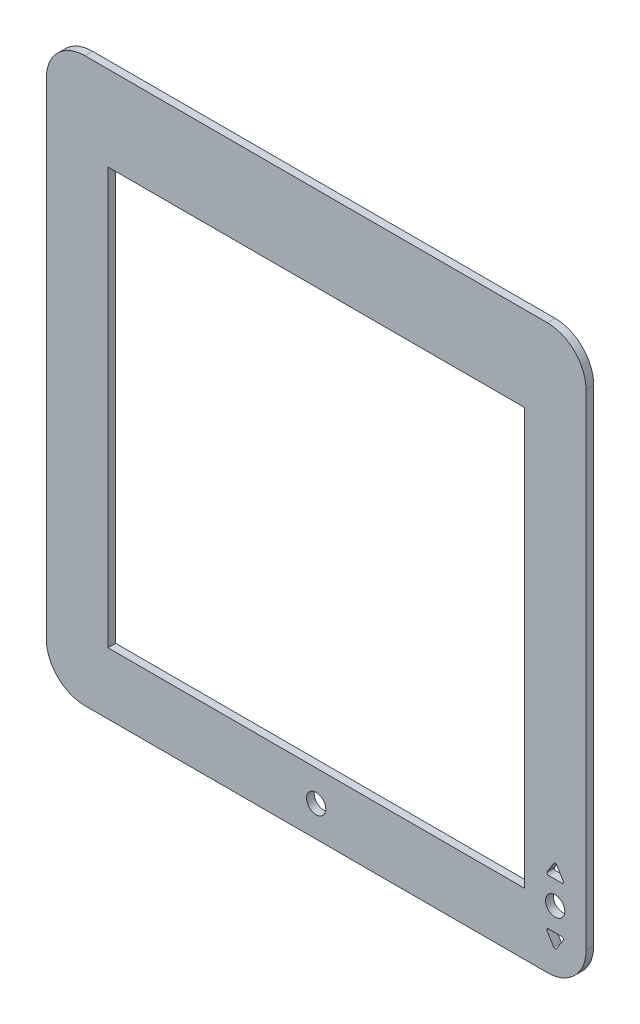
from build123d import *

# Parameters (mm, degrees)
SKETCH1_W           = 540
SKETCH1_H           = 540
BOSS_EXTRUDE1_DEPTH = 10
FILLET1_R           = 50
CUT_EXTRUDE1_REACH  = 518.72
SKETCH2_R           = 12.5
CUT_EXTRUDE2_REACH  = 518.72
SKETCH3_R           = 12.5
FILLET2_R           = 2


with BuildPart() as part:
    # Sketch1 → Boss-Extrude1 (new body)
    with BuildSketch(Plane.XY):
        Polygon((-350, -350), (-350, 350), (-350, 380), (350, 380), (350, 350), (350, -350), align=None)
        Rectangle(SKETCH1_W, SKETCH1_H, mode=Mode.SUBTRACT)
    extrude(amount=BOSS_EXTRUDE1_DEPTH)

    # Fillet1
    fillet1_edges = [part.edges().sort_by_distance(p)[0] for p in [
        (350, -350, 5),
        (-350, -350, 5),
        (-350, 380, 5),
        (350, 380, 5),
    ]]
    fillet(fillet1_edges, radius=FILLET1_R)

    # Sketch2 → Cut-Extrude1 (cut, up to next)
    with BuildSketch(Plane.XY.offset(10), mode=Mode.PRIVATE) as cut_extrude1_sk1:
        with Locations((0, -310)):
            Circle(SKETCH2_R)
    cut_extrude1_tool1 = extrude(cut_extrude1_sk1.sketch, amount=-CUT_EXTRUDE1_REACH, mode=Mode.PRIVATE) & part.part
    add(cut_extrude1_tool1.solids().sort_by_distance((0, -310, 10))[0], mode=Mode.SUBTRACT)

    # Sketch3 → Cut-Extrude2 (cut, up to next)
    with BuildSketch(Plane.XY.offset(10), mode=Mode.PRIVATE) as cut_extrude2_sk1:
        with Locations((310, -270)):
            Circle(SKETCH3_R)
    cut_extrude2_tool1 = extrude(cut_extrude2_sk1.sketch, amount=-CUT_EXTRUDE2_REACH, mode=Mode.PRIVATE) & part.part
    # Sketch3 → Cut-Extrude2 (cut, up to next)
    with BuildSketch(Plane.XY.offset(10), mode=Mode.PRIVATE) as cut_extrude2_sk2:
        Polygon((297.5, -240), (322.5, -240), (309.997387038, -220), align=None)
    cut_extrude2_tool2 = extrude(cut_extrude2_sk2.sketch, amount=-CUT_EXTRUDE2_REACH, mode=Mode.PRIVATE) & part.part
    # Sketch3 → Cut-Extrude2 (cut, up to next)
    with BuildSketch(Plane.XY.offset(10), mode=Mode.PRIVATE) as cut_extrude2_sk3:
        Polygon((297.5, -300), (322.5, -300), (310, -320.001633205), align=None)
    cut_extrude2_tool3 = extrude(cut_extrude2_sk3.sketch, amount=-CUT_EXTRUDE2_REACH, mode=Mode.PRIVATE) & part.part
    add(cut_extrude2_tool1.solids().sort_by_distance((310, -270, 10))[0], mode=Mode.SUBTRACT)
    add(cut_extrude2_tool2.solids().sort_by_distance((309.999129, -233.333333, 10))[0], mode=Mode.SUBTRACT)
    add(cut_extrude2_tool3.solids().sort_by_distance((310, -306.667211, 10))[0], mode=Mode.SUBTRACT)

    # Fillet2
    fillet2_edges = [part.edges().sort_by_distance(p)[0] for p in [
        (310, -320.001633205, 5),
        (297.5, -300, 5),
        (322.5, -300, 5),
        (297.5, -240, 5),
        (309.997387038, -220, 5),
        (322.5, -240, 5),
    ]]
    fillet(fillet2_edges, radius=FILLET2_R)


solid = part.part
